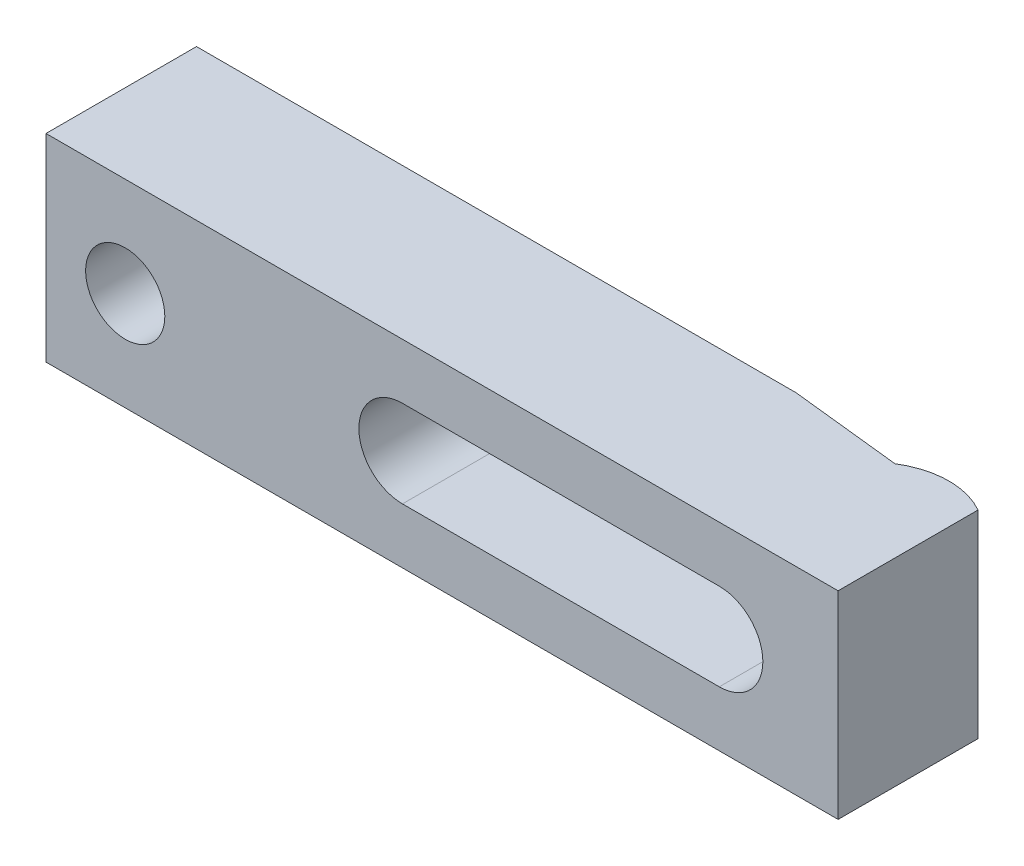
ISO-10303-21;
HEADER;
FILE_DESCRIPTION(('STEP AP214'),'2;1');
FILE_NAME('part.step','',(''),(''),'','','');
FILE_SCHEMA(('AUTOMOTIVE_DESIGN { 1 0 10303 214 1 1 1 1 }'));
ENDSEC;
DATA;
#1=APPLICATION_CONTEXT('core data for automotive mechanical design processes');
#2=APPLICATION_PROTOCOL_DEFINITION('international standard','automotive_design',2000,#1);
#3=PRODUCT_CONTEXT('',#1,'mechanical');
#4=PRODUCT('Part','Part','',(#3));
#5=PRODUCT_RELATED_PRODUCT_CATEGORY('part','',(#4));
#6=PRODUCT_DEFINITION_FORMATION('','',#4);
#7=PRODUCT_DEFINITION_CONTEXT('part definition',#1,'design');
#8=PRODUCT_DEFINITION('design','',#6,#7);
#9=PRODUCT_DEFINITION_SHAPE('','',#8);
#10=(LENGTH_UNIT() NAMED_UNIT(*) SI_UNIT(.MILLI.,.METRE.));
#11=(NAMED_UNIT(*) PLANE_ANGLE_UNIT() SI_UNIT($,.RADIAN.));
#12=(NAMED_UNIT(*) SI_UNIT($,.STERADIAN.) SOLID_ANGLE_UNIT());
#13=UNCERTAINTY_MEASURE_WITH_UNIT(LENGTH_MEASURE(1.E-05),#10,'distance_accuracy_value','');
#14=(GEOMETRIC_REPRESENTATION_CONTEXT(3) GLOBAL_UNCERTAINTY_ASSIGNED_CONTEXT((#13)) GLOBAL_UNIT_ASSIGNED_CONTEXT((#10,
#11,#12)) REPRESENTATION_CONTEXT('',''));
#15=CARTESIAN_POINT('',(0.,0.,0.));
#16=DIRECTION('',(0.,0.,1.));
#17=DIRECTION('',(1.,0.,0.));
#18=AXIS2_PLACEMENT_3D('',#15,#16,#17);
#19=CARTESIAN_POINT('',(-85.,12.5,0.));
#20=DIRECTION('',(0.,0.,-1.));
#21=DIRECTION('',(-1.,0.,0.));
#22=AXIS2_PLACEMENT_3D('',#19,#20,#21);
#23=PLANE('',#22);
#24=DIRECTION('',(1.,0.,0.));
#25=VECTOR('',#24,1.);
#26=CARTESIAN_POINT('',(-40.,5.5,0.));
#27=LINE('',#26,#25);
#28=CARTESIAN_POINT('',(-85.,5.5,0.));
#29=VERTEX_POINT('',#28);
#30=CARTESIAN_POINT('',(-9.3,5.5,0.));
#31=VERTEX_POINT('',#30);
#32=EDGE_CURVE('E127',#29,#31,#27,.T.);
#33=ORIENTED_EDGE('',*,*,#32,.F.);
#34=DIRECTION('',(0.,-1.,0.));
#35=VECTOR('',#34,1.);
#36=CARTESIAN_POINT('',(-85.,12.5,0.));
#37=LINE('',#36,#35);
#38=CARTESIAN_POINT('',(-85.,12.5,0.));
#39=VERTEX_POINT('',#38);
#40=EDGE_CURVE('E144',#39,#29,#37,.T.);
#41=ORIENTED_EDGE('',*,*,#40,.F.);
#42=DIRECTION('',(1.,0.,0.));
#43=VECTOR('',#42,1.);
#44=CARTESIAN_POINT('',(-85.,12.5,0.));
#45=LINE('',#44,#43);
#46=CARTESIAN_POINT('',(-9.3,12.5,0.));
#47=VERTEX_POINT('',#46);
#48=EDGE_CURVE('E262',#39,#47,#45,.T.);
#49=ORIENTED_EDGE('',*,*,#48,.T.);
#50=DIRECTION('',(0.,-1.,0.));
#51=VECTOR('',#50,1.);
#52=CARTESIAN_POINT('',(-9.3,12.5,0.));
#53=LINE('',#52,#51);
#54=EDGE_CURVE('E152',#47,#31,#53,.T.);
#55=ORIENTED_EDGE('',*,*,#54,.T.);
#56=EDGE_LOOP('',(#33,#41,#49,#55));
#57=FACE_BOUND('',#56,.T.);
#58=ADVANCED_FACE('F14',(#57),#23,.T.);
#59=CARTESIAN_POINT('',(-85.,12.5,19.));
#60=DIRECTION('',(-1.,0.,0.));
#61=DIRECTION('',(0.,0.,1.));
#62=AXIS2_PLACEMENT_3D('',#59,#60,#61);
#63=PLANE('',#62);
#64=ORIENTED_EDGE('',*,*,#40,.T.);
#65=DIRECTION('',(0.,0.,1.));
#66=VECTOR('',#65,1.);
#67=CARTESIAN_POINT('',(-85.,5.5,19.));
#68=LINE('',#67,#66);
#69=CARTESIAN_POINT('',(-85.,5.5,5.));
#70=VERTEX_POINT('',#69);
#71=EDGE_CURVE('E138',#29,#70,#68,.T.);
#72=ORIENTED_EDGE('',*,*,#71,.T.);
#73=DIRECTION('',(0.,-1.,0.));
#74=VECTOR('',#73,1.);
#75=CARTESIAN_POINT('',(-85.,12.5,5.));
#76=LINE('',#75,#74);
#77=CARTESIAN_POINT('',(-85.,-5.5,5.));
#78=VERTEX_POINT('',#77);
#79=EDGE_CURVE('E137',#70,#78,#76,.T.);
#80=ORIENTED_EDGE('',*,*,#79,.T.);
#81=DIRECTION('',(0.,0.,1.));
#82=VECTOR('',#81,1.);
#83=CARTESIAN_POINT('',(-85.,-5.5,19.));
#84=LINE('',#83,#82);
#85=CARTESIAN_POINT('',(-85.,-5.5,0.));
#86=VERTEX_POINT('',#85);
#87=EDGE_CURVE('E120',#86,#78,#84,.T.);
#88=ORIENTED_EDGE('',*,*,#87,.F.);
#89=CARTESIAN_POINT('',(-85.,-12.5,0.));
#90=VERTEX_POINT('',#89);
#91=EDGE_CURVE('E134',#86,#90,#37,.T.);
#92=ORIENTED_EDGE('',*,*,#91,.T.);
#93=DIRECTION('',(0.,0.,-1.));
#94=VECTOR('',#93,1.);
#95=CARTESIAN_POINT('',(-85.,-12.5,19.));
#96=LINE('',#95,#94);
#97=CARTESIAN_POINT('',(-85.,-12.5,19.));
#98=VERTEX_POINT('',#97);
#99=EDGE_CURVE('E285',#98,#90,#96,.T.);
#100=ORIENTED_EDGE('',*,*,#99,.F.);
#101=DIRECTION('',(0.,-1.,0.));
#102=VECTOR('',#101,1.);
#103=CARTESIAN_POINT('',(-85.,12.5,19.));
#104=LINE('',#103,#102);
#105=CARTESIAN_POINT('',(-85.,12.5,19.));
#106=VERTEX_POINT('',#105);
#107=EDGE_CURVE('E145',#106,#98,#104,.T.);
#108=ORIENTED_EDGE('',*,*,#107,.F.);
#109=DIRECTION('',(0.,0.,-1.));
#110=VECTOR('',#109,1.);
#111=CARTESIAN_POINT('',(-85.,12.5,19.));
#112=LINE('',#111,#110);
#113=EDGE_CURVE('E258',#106,#39,#112,.T.);
#114=ORIENTED_EDGE('',*,*,#113,.T.);
#115=EDGE_LOOP('',(#64,#72,#80,#88,#92,#100,#108,#114));
#116=FACE_BOUND('',#115,.T.);
#117=ADVANCED_FACE('F132',(#116),#63,.T.);
#118=CARTESIAN_POINT('',(-40.,0.,19.));
#119=DIRECTION('',(0.,0.,-1.));
#120=DIRECTION('',(-1.,0.,0.));
#121=AXIS2_PLACEMENT_3D('',#118,#119,#120);
#122=CYLINDRICAL_SURFACE('',#121,5.5);
#123=DIRECTION('',(0.,0.,-1.));
#124=VECTOR('',#123,1.);
#125=CARTESIAN_POINT('',(-40.,-5.5,19.));
#126=LINE('',#125,#124);
#127=CARTESIAN_POINT('',(-40.,-5.5,19.));
#128=VERTEX_POINT('',#127);
#129=CARTESIAN_POINT('',(-40.,-5.5,5.));
#130=VERTEX_POINT('',#129);
#131=EDGE_CURVE('E176',#128,#130,#126,.T.);
#132=ORIENTED_EDGE('',*,*,#131,.T.);
#133=CARTESIAN_POINT('',(-40.,0.,5.));
#134=DIRECTION('',(0.,0.,-1.));
#135=DIRECTION('',(-1.,0.,0.));
#136=AXIS2_PLACEMENT_3D('',#133,#134,#135);
#137=CIRCLE('',#136,5.5);
#138=CARTESIAN_POINT('',(-40.,5.5,5.));
#139=VERTEX_POINT('',#138);
#140=EDGE_CURVE('E300',#130,#139,#137,.T.);
#141=ORIENTED_EDGE('',*,*,#140,.T.);
#142=DIRECTION('',(0.,0.,-1.));
#143=VECTOR('',#142,1.);
#144=CARTESIAN_POINT('',(-40.,5.5,19.));
#145=LINE('',#144,#143);
#146=CARTESIAN_POINT('',(-40.,5.5,19.));
#147=VERTEX_POINT('',#146);
#148=EDGE_CURVE('E178',#147,#139,#145,.T.);
#149=ORIENTED_EDGE('',*,*,#148,.F.);
#150=CARTESIAN_POINT('',(-40.,0.,19.));
#151=DIRECTION('',(0.,0.,1.));
#152=DIRECTION('',(1.,0.,0.));
#153=AXIS2_PLACEMENT_3D('',#150,#151,#152);
#154=CIRCLE('',#153,5.5);
#155=EDGE_CURVE('E38',#147,#128,#154,.T.);
#156=ORIENTED_EDGE('',*,*,#155,.T.);
#157=EDGE_LOOP('',(#132,#141,#149,#156));
#158=FACE_BOUND('',#157,.T.);
#159=ADVANCED_FACE('F215',(#158),#122,.F.);
#160=CARTESIAN_POINT('',(-75.,0.,19.));
#161=DIRECTION('',(0.,0.,-1.));
#162=DIRECTION('',(-1.,0.,0.));
#163=AXIS2_PLACEMENT_3D('',#160,#161,#162);
#164=CYLINDRICAL_SURFACE('',#163,5.);
#165=CARTESIAN_POINT('',(-75.,0.,19.));
#166=DIRECTION('',(0.,0.,1.));
#167=DIRECTION('',(1.,0.,0.));
#168=AXIS2_PLACEMENT_3D('',#165,#166,#167);
#169=CIRCLE('',#168,5.);
#170=CARTESIAN_POINT('',(-70.,0.,19.));
#171=VERTEX_POINT('',#170);
#172=EDGE_CURVE('E254',#171,#171,#169,.T.);
#173=ORIENTED_EDGE('',*,*,#172,.T.);
#174=EDGE_LOOP('',(#173));
#175=FACE_BOUND('',#174,.T.);
#176=CARTESIAN_POINT('',(-75.,0.,5.));
#177=DIRECTION('',(0.,0.,-1.));
#178=DIRECTION('',(-1.,0.,0.));
#179=AXIS2_PLACEMENT_3D('',#176,#177,#178);
#180=CIRCLE('',#179,5.);
#181=CARTESIAN_POINT('',(-80.,0.,5.));
#182=VERTEX_POINT('',#181);
#183=EDGE_CURVE('E18',#182,#182,#180,.T.);
#184=ORIENTED_EDGE('',*,*,#183,.T.);
#185=EDGE_LOOP('',(#184));
#186=FACE_BOUND('',#185,.T.);
#187=ADVANCED_FACE('F210',(#175,#186),#164,.F.);
#188=CARTESIAN_POINT('',(15.,12.5,19.));
#189=DIRECTION('',(0.,0.,1.));
#190=DIRECTION('',(1.,0.,0.));
#191=AXIS2_PLACEMENT_3D('',#188,#189,#190);
#192=PLANE('',#191);
#193=DIRECTION('',(1.,0.,0.));
#194=VECTOR('',#193,1.);
#195=CARTESIAN_POINT('',(-40.,5.5,19.));
#196=LINE('',#195,#194);
#197=CARTESIAN_POINT('',(0.,5.5,19.));
#198=VERTEX_POINT('',#197);
#199=EDGE_CURVE('E294',#147,#198,#196,.T.);
#200=ORIENTED_EDGE('',*,*,#199,.T.);
#201=CARTESIAN_POINT('',(0.,0.,19.));
#202=DIRECTION('',(0.,0.,1.));
#203=DIRECTION('',(1.,0.,0.));
#204=AXIS2_PLACEMENT_3D('',#201,#202,#203);
#205=CIRCLE('',#204,5.5);
#206=CARTESIAN_POINT('',(0.,-5.5,19.));
#207=VERTEX_POINT('',#206);
#208=EDGE_CURVE('E126',#207,#198,#205,.T.);
#209=ORIENTED_EDGE('',*,*,#208,.F.);
#210=DIRECTION('',(-1.,0.,0.));
#211=VECTOR('',#210,1.);
#212=CARTESIAN_POINT('',(0.,-5.5,19.));
#213=LINE('',#212,#211);
#214=EDGE_CURVE('E174',#207,#128,#213,.T.);
#215=ORIENTED_EDGE('',*,*,#214,.T.);
#216=ORIENTED_EDGE('',*,*,#155,.F.);
#217=EDGE_LOOP('',(#200,#209,#215,#216));
#218=FACE_BOUND('',#217,.T.);
#219=DIRECTION('',(0.,-1.,0.));
#220=VECTOR('',#219,1.);
#221=CARTESIAN_POINT('',(15.,12.5,19.));
#222=LINE('',#221,#220);
#223=CARTESIAN_POINT('',(15.,12.5,19.));
#224=VERTEX_POINT('',#223);
#225=CARTESIAN_POINT('',(15.,-12.5,19.));
#226=VERTEX_POINT('',#225);
#227=EDGE_CURVE('E161',#224,#226,#222,.T.);
#228=ORIENTED_EDGE('',*,*,#227,.F.);
#229=DIRECTION('',(-1.,0.,0.));
#230=VECTOR('',#229,1.);
#231=CARTESIAN_POINT('',(15.,12.5,19.));
#232=LINE('',#231,#230);
#233=EDGE_CURVE('E263',#224,#106,#232,.T.);
#234=ORIENTED_EDGE('',*,*,#233,.T.);
#235=ORIENTED_EDGE('',*,*,#107,.T.);
#236=DIRECTION('',(-1.,0.,0.));
#237=VECTOR('',#236,1.);
#238=CARTESIAN_POINT('',(15.,-12.5,19.));
#239=LINE('',#238,#237);
#240=EDGE_CURVE('E198',#226,#98,#239,.T.);
#241=ORIENTED_EDGE('',*,*,#240,.F.);
#242=EDGE_LOOP('',(#228,#234,#235,#241));
#243=FACE_BOUND('',#242,.T.);
#244=ORIENTED_EDGE('',*,*,#172,.F.);
#245=EDGE_LOOP('',(#244));
#246=FACE_BOUND('',#245,.T.);
#247=ADVANCED_FACE('F228',(#218,#243,#246),#192,.T.);
#248=ORIENTED_EDGE('',*,*,#91,.F.);
#249=DIRECTION('',(-1.,0.,0.));
#250=VECTOR('',#249,1.);
#251=CARTESIAN_POINT('',(0.,-5.5,0.));
#252=LINE('',#251,#250);
#253=CARTESIAN_POINT('',(-9.3,-5.5,0.));
#254=VERTEX_POINT('',#253);
#255=EDGE_CURVE('E115',#254,#86,#252,.T.);
#256=ORIENTED_EDGE('',*,*,#255,.F.);
#257=CARTESIAN_POINT('',(-9.3,-12.5,0.));
#258=VERTEX_POINT('',#257);
#259=EDGE_CURVE('E147',#254,#258,#53,.T.);
#260=ORIENTED_EDGE('',*,*,#259,.T.);
#261=DIRECTION('',(1.,0.,0.));
#262=VECTOR('',#261,1.);
#263=CARTESIAN_POINT('',(-85.,-12.5,0.));
#264=LINE('',#263,#262);
#265=EDGE_CURVE('E143',#90,#258,#264,.T.);
#266=ORIENTED_EDGE('',*,*,#265,.F.);
#267=EDGE_LOOP('',(#248,#256,#260,#266));
#268=FACE_BOUND('',#267,.T.);
#269=ADVANCED_FACE('F141',(#268),#23,.T.);
#270=CARTESIAN_POINT('',(10.,12.5,10.));
#271=DIRECTION('',(0.,-1.,0.));
#272=DIRECTION('',(0.,0.,-1.));
#273=AXIS2_PLACEMENT_3D('',#270,#271,#272);
#274=CYLINDRICAL_SURFACE('',#273,10.);
#275=CARTESIAN_POINT('',(4.49084420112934,3.1752666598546,1.65439023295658));
#276=CARTESIAN_POINT('',(4.56984809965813,3.06359534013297,1.60224264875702));
#277=CARTESIAN_POINT('',(4.64546895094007,2.94773997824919,1.55392976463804));
#278=CARTESIAN_POINT('',(4.78884780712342,2.70855450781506,1.46471759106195));
#279=CARTESIAN_POINT('',(4.85660597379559,2.58522455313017,1.42381814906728));
#280=CARTESIAN_POINT('',(4.98308144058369,2.33214786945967,1.34922483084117));
#281=CARTESIAN_POINT('',(5.04181070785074,2.2024099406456,1.31552139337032));
#282=CARTESIAN_POINT('',(5.14945828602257,1.93740120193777,1.25494057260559));
#283=CARTESIAN_POINT('',(5.19837748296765,1.80213089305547,1.22806257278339));
#284=CARTESIAN_POINT('',(5.28309654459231,1.53534952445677,1.18223384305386));
#285=CARTESIAN_POINT('',(5.31950515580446,1.40409594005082,1.1629057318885));
#286=CARTESIAN_POINT('',(5.38259832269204,1.13853677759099,1.1297759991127));
#287=CARTESIAN_POINT('',(5.4092794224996,1.00423013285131,1.11597634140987));
#288=CARTESIAN_POINT('',(5.45256455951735,0.733683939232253,1.09374247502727));
#289=CARTESIAN_POINT('',(5.46917715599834,0.597446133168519,1.08530370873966));
#290=CARTESIAN_POINT('',(5.49217577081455,0.323825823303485,1.07365206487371));
#291=CARTESIAN_POINT('',(5.49855713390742,0.186442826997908,1.07044156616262));
#292=CARTESIAN_POINT('',(5.50100923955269,-0.0887714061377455,1.06920584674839));
#293=CARTESIAN_POINT('',(5.49705497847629,-0.226602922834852,1.07119320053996));
#294=CARTESIAN_POINT('',(5.47883194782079,-0.501343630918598,1.08040678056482));
#295=CARTESIAN_POINT('',(5.46456785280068,-0.638253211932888,1.0876306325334));
#296=CARTESIAN_POINT('',(5.42587847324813,-0.910352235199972,1.10742533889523));
#297=CARTESIAN_POINT('',(5.40144496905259,-1.04554019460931,1.12000051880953));
#298=CARTESIAN_POINT('',(5.34271514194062,-1.3130660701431,1.15066142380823));
#299=CARTESIAN_POINT('',(5.30842257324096,-1.44540505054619,1.16874505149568));
#300=CARTESIAN_POINT('',(5.23037882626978,-1.70636668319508,1.21064993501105));
#301=CARTESIAN_POINT('',(5.18662550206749,-1.83498848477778,1.23447249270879));
#302=CARTESIAN_POINT('',(5.09021998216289,-2.0875676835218,1.28810589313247));
#303=CARTESIAN_POINT('',(5.03756762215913,-2.21152499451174,1.3179168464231));
#304=CARTESIAN_POINT('',(4.92401628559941,-2.45397026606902,1.38381149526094));
#305=CARTESIAN_POINT('',(4.86311213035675,-2.57245472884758,1.41989913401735));
#306=CARTESIAN_POINT('',(4.73394184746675,-2.80309686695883,1.49856949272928));
#307=CARTESIAN_POINT('',(4.66567519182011,-2.91525408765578,1.54115267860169));
#308=CARTESIAN_POINT('',(4.59416135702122,-3.0238520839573,1.58709868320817));
#309=B_SPLINE_CURVE_WITH_KNOTS('',3,(#275,#276,#277,#278,#279,#280,#281,#282,#283,#284,#285,
#286,#287,#288,#289,#290,#291,#292,#293,#294,#295,#296,#297,#298,#299,#300,#301,#302,#303,#304,
#305,#306,#307,#308),.UNSPECIFIED.,.F.,.F.,(4,2,2,2,2,2,2,2,2,2,2,2,2,2,2,2,4),(0.,
0.439039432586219,0.878069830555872,1.31651321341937,1.75491697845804,2.16715557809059,
2.57954049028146,2.99157433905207,3.4037956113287,3.81701503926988,4.23004722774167,
4.64341390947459,5.05662339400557,5.46992670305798,5.88323764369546,6.29680918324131,
6.71041040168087),.UNSPECIFIED.);
#310=CARTESIAN_POINT('',(4.7,2.85657137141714,1.52002358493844));
#311=VERTEX_POINT('',#310);
#312=CARTESIAN_POINT('',(4.7,-2.85657137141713,1.52002358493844));
#313=VERTEX_POINT('',#312);
#314=EDGE_CURVE('E170',#311,#313,#309,.T.);
#315=ORIENTED_EDGE('',*,*,#314,.F.);
#316=DIRECTION('',(0.,-1.,0.));
#317=VECTOR('',#316,1.);
#318=CARTESIAN_POINT('',(4.7,12.5,1.52002358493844));
#319=LINE('',#318,#317);
#320=CARTESIAN_POINT('',(4.7,12.5,1.52002358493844));
#321=VERTEX_POINT('',#320);
#322=EDGE_CURVE('E156',#321,#311,#319,.T.);
#323=ORIENTED_EDGE('',*,*,#322,.F.);
#324=CARTESIAN_POINT('',(10.,12.5,10.));
#325=DIRECTION('',(0.,1.,0.));
#326=DIRECTION('',(0.,0.,1.));
#327=AXIS2_PLACEMENT_3D('',#324,#325,#326);
#328=CIRCLE('',#327,10.);
#329=CARTESIAN_POINT('',(15.,12.5,1.33974596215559));
#330=VERTEX_POINT('',#329);
#331=EDGE_CURVE('E270',#330,#321,#328,.T.);
#332=ORIENTED_EDGE('',*,*,#331,.F.);
#333=DIRECTION('',(0.,-1.,0.));
#334=VECTOR('',#333,1.);
#335=CARTESIAN_POINT('',(15.,12.5,1.33974596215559));
#336=LINE('',#335,#334);
#337=CARTESIAN_POINT('',(15.,-12.5,1.33974596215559));
#338=VERTEX_POINT('',#337);
#339=EDGE_CURVE('E159',#330,#338,#336,.T.);
#340=ORIENTED_EDGE('',*,*,#339,.T.);
#341=CARTESIAN_POINT('',(10.,-12.5,10.));
#342=DIRECTION('',(0.,1.,0.));
#343=DIRECTION('',(0.,0.,1.));
#344=AXIS2_PLACEMENT_3D('',#341,#342,#343);
#345=CIRCLE('',#344,10.);
#346=CARTESIAN_POINT('',(4.7,-12.5,1.52002358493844));
#347=VERTEX_POINT('',#346);
#348=EDGE_CURVE('E275',#338,#347,#345,.T.);
#349=ORIENTED_EDGE('',*,*,#348,.T.);
#350=EDGE_CURVE('E155',#313,#347,#319,.T.);
#351=ORIENTED_EDGE('',*,*,#350,.F.);
#352=EDGE_LOOP('',(#315,#323,#332,#340,#349,#351));
#353=FACE_BOUND('',#352,.T.);
#354=ADVANCED_FACE('F201',(#353),#274,.T.);
#355=CARTESIAN_POINT('',(4.7,12.5,1.52002358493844));
#356=DIRECTION('',(-0.107938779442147,0.,0.994157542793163));
#357=DIRECTION('',(0.994157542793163,0.,0.107938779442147));
#358=AXIS2_PLACEMENT_3D('',#355,#356,#357);
#359=PLANE('',#358);
#360=CARTESIAN_POINT('',(0.,0.,1.00972995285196));
#361=DIRECTION('',(-0.107938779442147,0.,0.994157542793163));
#362=DIRECTION('',(-0.994157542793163,0.,-0.107938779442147));
#363=AXIS2_PLACEMENT_3D('',#360,#361,#362);
#364=ELLIPSE('',#363,5.532322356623,5.5);
#365=CARTESIAN_POINT('',(0.,5.5,1.00972995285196));
#366=VERTEX_POINT('',#365);
#367=EDGE_CURVE('E9',#366,#311,#364,.F.);
#368=ORIENTED_EDGE('',*,*,#367,.F.);
#369=DIRECTION('',(-0.994157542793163,0.,-0.107938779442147));
#370=VECTOR('',#369,1.);
#371=CARTESIAN_POINT('',(4.7,5.5,1.52002358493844));
#372=LINE('',#371,#370);
#373=EDGE_CURVE('E190',#366,#31,#372,.T.);
#374=ORIENTED_EDGE('',*,*,#373,.T.);
#375=ORIENTED_EDGE('',*,*,#54,.F.);
#376=DIRECTION('',(-0.994157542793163,0.,-0.107938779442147));
#377=VECTOR('',#376,1.);
#378=CARTESIAN_POINT('',(4.7,12.5,1.52002358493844));
#379=LINE('',#378,#377);
#380=EDGE_CURVE('E268',#321,#47,#379,.T.);
#381=ORIENTED_EDGE('',*,*,#380,.F.);
#382=ORIENTED_EDGE('',*,*,#322,.T.);
#383=EDGE_LOOP('',(#368,#374,#375,#381,#382));
#384=FACE_BOUND('',#383,.T.);
#385=ADVANCED_FACE('F235',(#384),#359,.F.);
#386=CARTESIAN_POINT('',(0.,-5.5,1.00972995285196));
#387=VERTEX_POINT('',#386);
#388=EDGE_CURVE('E23',#313,#387,#364,.F.);
#389=ORIENTED_EDGE('',*,*,#388,.F.);
#390=ORIENTED_EDGE('',*,*,#350,.T.);
#391=DIRECTION('',(-0.994157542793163,0.,-0.107938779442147));
#392=VECTOR('',#391,1.);
#393=CARTESIAN_POINT('',(4.7,-12.5,1.52002358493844));
#394=LINE('',#393,#392);
#395=EDGE_CURVE('E279',#347,#258,#394,.T.);
#396=ORIENTED_EDGE('',*,*,#395,.T.);
#397=ORIENTED_EDGE('',*,*,#259,.F.);
#398=DIRECTION('',(0.994157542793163,0.,0.107938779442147));
#399=VECTOR('',#398,1.);
#400=CARTESIAN_POINT('',(4.7,-5.5,1.52002358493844));
#401=LINE('',#400,#399);
#402=EDGE_CURVE('E122',#254,#387,#401,.T.);
#403=ORIENTED_EDGE('',*,*,#402,.T.);
#404=EDGE_LOOP('',(#389,#390,#396,#397,#403));
#405=FACE_BOUND('',#404,.T.);
#406=ADVANCED_FACE('F237',(#405),#359,.F.);
#407=CARTESIAN_POINT('',(15.,12.5,19.));
#408=DIRECTION('',(-1.,0.,0.));
#409=DIRECTION('',(0.,0.,1.));
#410=AXIS2_PLACEMENT_3D('',#407,#408,#409);
#411=PLANE('',#410);
#412=ORIENTED_EDGE('',*,*,#339,.F.);
#413=DIRECTION('',(0.,0.,-1.));
#414=VECTOR('',#413,1.);
#415=CARTESIAN_POINT('',(15.,12.5,19.));
#416=LINE('',#415,#414);
#417=EDGE_CURVE('E148',#224,#330,#416,.T.);
#418=ORIENTED_EDGE('',*,*,#417,.F.);
#419=ORIENTED_EDGE('',*,*,#227,.T.);
#420=DIRECTION('',(0.,0.,-1.));
#421=VECTOR('',#420,1.);
#422=CARTESIAN_POINT('',(15.,-12.5,19.));
#423=LINE('',#422,#421);
#424=EDGE_CURVE('E199',#226,#338,#423,.T.);
#425=ORIENTED_EDGE('',*,*,#424,.T.);
#426=EDGE_LOOP('',(#412,#418,#419,#425));
#427=FACE_BOUND('',#426,.T.);
#428=ADVANCED_FACE('F16',(#427),#411,.F.);
#429=CARTESIAN_POINT('',(10.,12.5,10.));
#430=DIRECTION('',(0.,1.,0.));
#431=DIRECTION('',(0.,0.,1.));
#432=AXIS2_PLACEMENT_3D('',#429,#430,#431);
#433=PLANE('',#432);
#434=ORIENTED_EDGE('',*,*,#233,.F.);
#435=ORIENTED_EDGE('',*,*,#417,.T.);
#436=ORIENTED_EDGE('',*,*,#331,.T.);
#437=ORIENTED_EDGE('',*,*,#380,.T.);
#438=ORIENTED_EDGE('',*,*,#48,.F.);
#439=ORIENTED_EDGE('',*,*,#113,.F.);
#440=EDGE_LOOP('',(#434,#435,#436,#437,#438,#439));
#441=FACE_BOUND('',#440,.T.);
#442=ADVANCED_FACE('F223',(#441),#433,.T.);
#443=CARTESIAN_POINT('',(10.,-12.5,10.));
#444=DIRECTION('',(0.,1.,0.));
#445=DIRECTION('',(0.,0.,1.));
#446=AXIS2_PLACEMENT_3D('',#443,#444,#445);
#447=PLANE('',#446);
#448=ORIENTED_EDGE('',*,*,#240,.T.);
#449=ORIENTED_EDGE('',*,*,#99,.T.);
#450=ORIENTED_EDGE('',*,*,#265,.T.);
#451=ORIENTED_EDGE('',*,*,#395,.F.);
#452=ORIENTED_EDGE('',*,*,#348,.F.);
#453=ORIENTED_EDGE('',*,*,#424,.F.);
#454=EDGE_LOOP('',(#448,#449,#450,#451,#452,#453));
#455=FACE_BOUND('',#454,.T.);
#456=ADVANCED_FACE('F209',(#455),#447,.F.);
#457=CARTESIAN_POINT('',(0.,0.,19.));
#458=DIRECTION('',(0.,0.,-1.));
#459=DIRECTION('',(-1.,0.,0.));
#460=AXIS2_PLACEMENT_3D('',#457,#458,#459);
#461=CYLINDRICAL_SURFACE('',#460,5.5);
#462=ORIENTED_EDGE('',*,*,#367,.T.);
#463=ORIENTED_EDGE('',*,*,#314,.T.);
#464=ORIENTED_EDGE('',*,*,#388,.T.);
#465=DIRECTION('',(0.,0.,-1.));
#466=VECTOR('',#465,1.);
#467=CARTESIAN_POINT('',(0.,-5.5,19.));
#468=LINE('',#467,#466);
#469=EDGE_CURVE('E167',#207,#387,#468,.T.);
#470=ORIENTED_EDGE('',*,*,#469,.F.);
#471=ORIENTED_EDGE('',*,*,#208,.T.);
#472=DIRECTION('',(0.,0.,-1.));
#473=VECTOR('',#472,1.);
#474=CARTESIAN_POINT('',(0.,5.5,19.));
#475=LINE('',#474,#473);
#476=EDGE_CURVE('E186',#198,#366,#475,.T.);
#477=ORIENTED_EDGE('',*,*,#476,.T.);
#478=EDGE_LOOP('',(#462,#463,#464,#470,#471,#477));
#479=FACE_BOUND('',#478,.T.);
#480=ADVANCED_FACE('F165',(#479),#461,.F.);
#481=CARTESIAN_POINT('',(-40.,5.5,19.));
#482=DIRECTION('',(0.,1.,0.));
#483=DIRECTION('',(-1.,0.,0.));
#484=AXIS2_PLACEMENT_3D('',#481,#482,#483);
#485=PLANE('',#484);
#486=ORIENTED_EDGE('',*,*,#32,.T.);
#487=ORIENTED_EDGE('',*,*,#373,.F.);
#488=ORIENTED_EDGE('',*,*,#476,.F.);
#489=ORIENTED_EDGE('',*,*,#199,.F.);
#490=ORIENTED_EDGE('',*,*,#148,.T.);
#491=DIRECTION('',(-1.,0.,0.));
#492=VECTOR('',#491,1.);
#493=CARTESIAN_POINT('',(-5.,5.5,5.));
#494=LINE('',#493,#492);
#495=EDGE_CURVE('E30',#139,#70,#494,.T.);
#496=ORIENTED_EDGE('',*,*,#495,.T.);
#497=ORIENTED_EDGE('',*,*,#71,.F.);
#498=EDGE_LOOP('',(#486,#487,#488,#489,#490,#496,#497));
#499=FACE_BOUND('',#498,.T.);
#500=ADVANCED_FACE('F208',(#499),#485,.F.);
#501=CARTESIAN_POINT('',(0.,-5.5,19.));
#502=DIRECTION('',(0.,-1.,0.));
#503=DIRECTION('',(1.,0.,0.));
#504=AXIS2_PLACEMENT_3D('',#501,#502,#503);
#505=PLANE('',#504);
#506=ORIENTED_EDGE('',*,*,#469,.T.);
#507=ORIENTED_EDGE('',*,*,#402,.F.);
#508=ORIENTED_EDGE('',*,*,#255,.T.);
#509=ORIENTED_EDGE('',*,*,#87,.T.);
#510=DIRECTION('',(-1.,0.,0.));
#511=VECTOR('',#510,1.);
#512=CARTESIAN_POINT('',(-5.,-5.5,5.));
#513=LINE('',#512,#511);
#514=EDGE_CURVE('E302',#130,#78,#513,.T.);
#515=ORIENTED_EDGE('',*,*,#514,.F.);
#516=ORIENTED_EDGE('',*,*,#131,.F.);
#517=ORIENTED_EDGE('',*,*,#214,.F.);
#518=EDGE_LOOP('',(#506,#507,#508,#509,#515,#516,#517));
#519=FACE_BOUND('',#518,.T.);
#520=ADVANCED_FACE('F118',(#519),#505,.F.);
#521=CARTESIAN_POINT('',(-5.,-5.5,5.));
#522=DIRECTION('',(0.,0.,-1.));
#523=DIRECTION('',(-1.,0.,0.));
#524=AXIS2_PLACEMENT_3D('',#521,#522,#523);
#525=PLANE('',#524);
#526=ORIENTED_EDGE('',*,*,#183,.F.);
#527=EDGE_LOOP('',(#526));
#528=FACE_BOUND('',#527,.T.);
#529=ORIENTED_EDGE('',*,*,#495,.F.);
#530=ORIENTED_EDGE('',*,*,#140,.F.);
#531=ORIENTED_EDGE('',*,*,#514,.T.);
#532=ORIENTED_EDGE('',*,*,#79,.F.);
#533=EDGE_LOOP('',(#529,#530,#531,#532));
#534=FACE_BOUND('',#533,.T.);
#535=ADVANCED_FACE('F214',(#528,#534),#525,.T.);
#536=CLOSED_SHELL('',(#58,#117,#159,#187,#247,#269,#354,#385,#406,#428,#442,#456,#480,#500,#520,#535));
#537=MANIFOLD_SOLID_BREP('B1',#536);
#538=ADVANCED_BREP_SHAPE_REPRESENTATION('',(#18,#537),#14);
#539=SHAPE_DEFINITION_REPRESENTATION(#9,#538);
ENDSEC;
END-ISO-10303-21;
